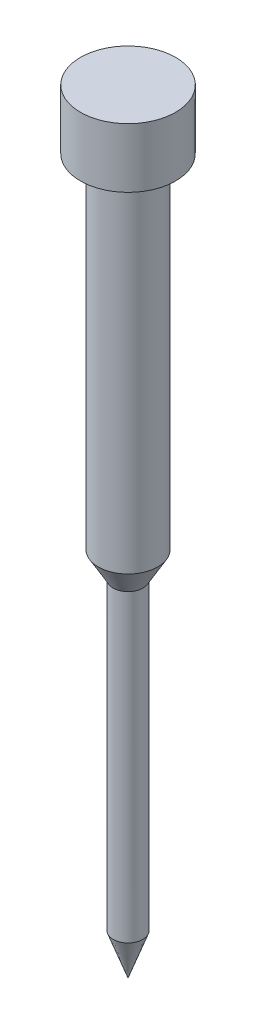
ISO-10303-21;
HEADER;
FILE_DESCRIPTION(('STEP AP214'),'2;1');
FILE_NAME('part.step','',(''),(''),'','','');
FILE_SCHEMA(('AUTOMOTIVE_DESIGN { 1 0 10303 214 1 1 1 1 }'));
ENDSEC;
DATA;
#1=APPLICATION_CONTEXT('core data for automotive mechanical design processes');
#2=APPLICATION_PROTOCOL_DEFINITION('international standard','automotive_design',2000,#1);
#3=PRODUCT_CONTEXT('',#1,'mechanical');
#4=PRODUCT('Part','Part','',(#3));
#5=PRODUCT_RELATED_PRODUCT_CATEGORY('part','',(#4));
#6=PRODUCT_DEFINITION_FORMATION('','',#4);
#7=PRODUCT_DEFINITION_CONTEXT('part definition',#1,'design');
#8=PRODUCT_DEFINITION('design','',#6,#7);
#9=PRODUCT_DEFINITION_SHAPE('','',#8);
#10=(LENGTH_UNIT() NAMED_UNIT(*) SI_UNIT(.MILLI.,.METRE.));
#11=(NAMED_UNIT(*) PLANE_ANGLE_UNIT() SI_UNIT($,.RADIAN.));
#12=(NAMED_UNIT(*) SI_UNIT($,.STERADIAN.) SOLID_ANGLE_UNIT());
#13=UNCERTAINTY_MEASURE_WITH_UNIT(LENGTH_MEASURE(1.E-05),#10,'distance_accuracy_value','');
#14=(GEOMETRIC_REPRESENTATION_CONTEXT(3) GLOBAL_UNCERTAINTY_ASSIGNED_CONTEXT((#13)) GLOBAL_UNIT_ASSIGNED_CONTEXT((#10,
#11,#12)) REPRESENTATION_CONTEXT('',''));
#15=CARTESIAN_POINT('',(0.,0.,0.));
#16=DIRECTION('',(0.,0.,1.));
#17=DIRECTION('',(1.,0.,0.));
#18=AXIS2_PLACEMENT_3D('',#15,#16,#17);
#19=CARTESIAN_POINT('',(-4.,65.,0.));
#20=DIRECTION('',(0.,-1.,0.));
#21=DIRECTION('',(0.,0.,-1.));
#22=AXIS2_PLACEMENT_3D('',#19,#20,#21);
#23=PLANE('',#22);
#24=CARTESIAN_POINT('',(0.,65.,0.));
#25=DIRECTION('',(0.,-1.,0.));
#26=DIRECTION('',(0.,0.,-1.));
#27=AXIS2_PLACEMENT_3D('',#24,#25,#26);
#28=CIRCLE('',#27,4.);
#29=CARTESIAN_POINT('',(0.,65.,-4.));
#30=VERTEX_POINT('',#29);
#31=EDGE_CURVE('E64',#30,#30,#28,.T.);
#32=ORIENTED_EDGE('',*,*,#31,.F.);
#33=EDGE_LOOP('',(#32));
#34=FACE_BOUND('',#33,.T.);
#35=ADVANCED_FACE('F32',(#34),#23,.F.);
#36=CARTESIAN_POINT('',(0.,3.43434677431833,0.));
#37=DIRECTION('',(0.,1.,0.));
#38=DIRECTION('',(0.,0.,1.));
#39=AXIS2_PLACEMENT_3D('',#36,#37,#38);
#40=CONICAL_SURFACE('',#39,1.25,0.349065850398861);
#41=CARTESIAN_POINT('',(0.,0.,0.));
#42=VERTEX_POINT('',#41);
#43=VERTEX_LOOP('',#42);
#44=FACE_BOUND('',#43,.T.);
#45=CARTESIAN_POINT('',(0.,3.43434677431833,0.));
#46=DIRECTION('',(0.,-1.,0.));
#47=DIRECTION('',(0.,0.,-1.));
#48=AXIS2_PLACEMENT_3D('',#45,#46,#47);
#49=CIRCLE('',#48,1.25);
#50=CARTESIAN_POINT('',(0.,3.43434677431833,-1.25));
#51=VERTEX_POINT('',#50);
#52=EDGE_CURVE('E11',#51,#51,#49,.T.);
#53=ORIENTED_EDGE('',*,*,#52,.T.);
#54=EDGE_LOOP('',(#53));
#55=FACE_BOUND('',#54,.T.);
#56=ADVANCED_FACE('F41',(#44,#55),#40,.T.);
#57=CARTESIAN_POINT('',(0.,0.,0.));
#58=DIRECTION('',(0.,-1.,0.));
#59=DIRECTION('',(0.,0.,-1.));
#60=AXIS2_PLACEMENT_3D('',#57,#58,#59);
#61=CYLINDRICAL_SURFACE('',#60,1.25);
#62=ORIENTED_EDGE('',*,*,#52,.F.);
#63=EDGE_LOOP('',(#62));
#64=FACE_BOUND('',#63,.T.);
#65=CARTESIAN_POINT('',(0.,29.,0.));
#66=DIRECTION('',(0.,-1.,0.));
#67=DIRECTION('',(0.,0.,-1.));
#68=AXIS2_PLACEMENT_3D('',#65,#66,#67);
#69=CIRCLE('',#68,1.25);
#70=CARTESIAN_POINT('',(0.,29.,-1.25));
#71=VERTEX_POINT('',#70);
#72=EDGE_CURVE('E38',#71,#71,#69,.T.);
#73=ORIENTED_EDGE('',*,*,#72,.T.);
#74=EDGE_LOOP('',(#73));
#75=FACE_BOUND('',#74,.T.);
#76=ADVANCED_FACE('F44',(#64,#75),#61,.T.);
#77=CARTESIAN_POINT('',(0.,31.1650635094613,0.));
#78=DIRECTION('',(0.,1.,0.));
#79=DIRECTION('',(0.,0.,1.));
#80=AXIS2_PLACEMENT_3D('',#77,#78,#79);
#81=CONICAL_SURFACE('',#80,2.5,0.523598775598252);
#82=ORIENTED_EDGE('',*,*,#72,.F.);
#83=EDGE_LOOP('',(#82));
#84=FACE_BOUND('',#83,.T.);
#85=CARTESIAN_POINT('',(0.,31.1650635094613,0.));
#86=DIRECTION('',(0.,-1.,0.));
#87=DIRECTION('',(0.,0.,-1.));
#88=AXIS2_PLACEMENT_3D('',#85,#86,#87);
#89=CIRCLE('',#88,2.5);
#90=CARTESIAN_POINT('',(0.,31.1650635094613,-2.5));
#91=VERTEX_POINT('',#90);
#92=EDGE_CURVE('E54',#91,#91,#89,.T.);
#93=ORIENTED_EDGE('',*,*,#92,.T.);
#94=EDGE_LOOP('',(#93));
#95=FACE_BOUND('',#94,.T.);
#96=ADVANCED_FACE('F49',(#84,#95),#81,.T.);
#97=CARTESIAN_POINT('',(0.,0.,0.));
#98=DIRECTION('',(0.,-1.,0.));
#99=DIRECTION('',(0.,0.,-1.));
#100=AXIS2_PLACEMENT_3D('',#97,#98,#99);
#101=CYLINDRICAL_SURFACE('',#100,2.5);
#102=ORIENTED_EDGE('',*,*,#92,.F.);
#103=EDGE_LOOP('',(#102));
#104=FACE_BOUND('',#103,.T.);
#105=CARTESIAN_POINT('',(0.,60.,0.));
#106=DIRECTION('',(0.,-1.,0.));
#107=DIRECTION('',(0.,0.,-1.));
#108=AXIS2_PLACEMENT_3D('',#105,#106,#107);
#109=CIRCLE('',#108,2.5);
#110=CARTESIAN_POINT('',(0.,60.,-2.5));
#111=VERTEX_POINT('',#110);
#112=EDGE_CURVE('E56',#111,#111,#109,.T.);
#113=ORIENTED_EDGE('',*,*,#112,.T.);
#114=EDGE_LOOP('',(#113));
#115=FACE_BOUND('',#114,.T.);
#116=ADVANCED_FACE('F87',(#104,#115),#101,.T.);
#117=CARTESIAN_POINT('',(-4.,60.,0.));
#118=DIRECTION('',(0.,1.,0.));
#119=DIRECTION('',(0.,0.,1.));
#120=AXIS2_PLACEMENT_3D('',#117,#118,#119);
#121=PLANE('',#120);
#122=ORIENTED_EDGE('',*,*,#112,.F.);
#123=EDGE_LOOP('',(#122));
#124=FACE_BOUND('',#123,.T.);
#125=CARTESIAN_POINT('',(0.,60.,0.));
#126=DIRECTION('',(0.,-1.,0.));
#127=DIRECTION('',(0.,0.,-1.));
#128=AXIS2_PLACEMENT_3D('',#125,#126,#127);
#129=CIRCLE('',#128,4.);
#130=CARTESIAN_POINT('',(0.,60.,-4.));
#131=VERTEX_POINT('',#130);
#132=EDGE_CURVE('E61',#131,#131,#129,.T.);
#133=ORIENTED_EDGE('',*,*,#132,.T.);
#134=EDGE_LOOP('',(#133));
#135=FACE_BOUND('',#134,.T.);
#136=ADVANCED_FACE('F94',(#124,#135),#121,.F.);
#137=CARTESIAN_POINT('',(0.,0.,0.));
#138=DIRECTION('',(0.,-1.,0.));
#139=DIRECTION('',(0.,0.,-1.));
#140=AXIS2_PLACEMENT_3D('',#137,#138,#139);
#141=CYLINDRICAL_SURFACE('',#140,4.);
#142=ORIENTED_EDGE('',*,*,#132,.F.);
#143=EDGE_LOOP('',(#142));
#144=FACE_BOUND('',#143,.T.);
#145=ORIENTED_EDGE('',*,*,#31,.T.);
#146=EDGE_LOOP('',(#145));
#147=FACE_BOUND('',#146,.T.);
#148=ADVANCED_FACE('F68',(#144,#147),#141,.T.);
#149=CLOSED_SHELL('',(#35,#56,#76,#96,#116,#136,#148));
#150=MANIFOLD_SOLID_BREP('B2',#149);
#151=ADVANCED_BREP_SHAPE_REPRESENTATION('',(#18,#150),#14);
#152=SHAPE_DEFINITION_REPRESENTATION(#9,#151);
ENDSEC;
END-ISO-10303-21;
